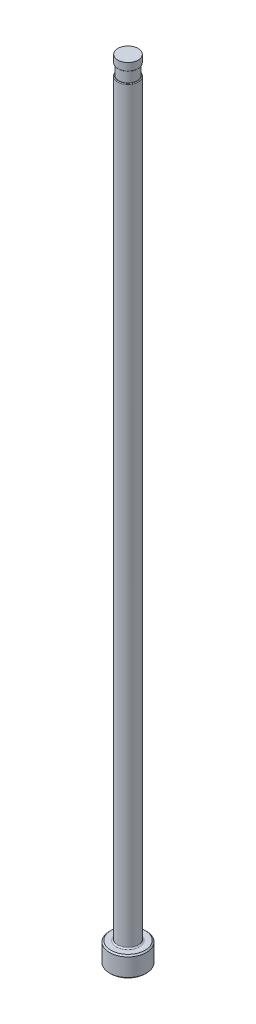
ISO-10303-21;
HEADER;
FILE_DESCRIPTION(('STEP AP214'),'2;1');
FILE_NAME('part.step','',(''),(''),'','','');
FILE_SCHEMA(('AUTOMOTIVE_DESIGN { 1 0 10303 214 1 1 1 1 }'));
ENDSEC;
DATA;
#1=APPLICATION_CONTEXT('core data for automotive mechanical design processes');
#2=APPLICATION_PROTOCOL_DEFINITION('international standard','automotive_design',2000,#1);
#3=PRODUCT_CONTEXT('',#1,'mechanical');
#4=PRODUCT('Part','Part','',(#3));
#5=PRODUCT_RELATED_PRODUCT_CATEGORY('part','',(#4));
#6=PRODUCT_DEFINITION_FORMATION('','',#4);
#7=PRODUCT_DEFINITION_CONTEXT('part definition',#1,'design');
#8=PRODUCT_DEFINITION('design','',#6,#7);
#9=PRODUCT_DEFINITION_SHAPE('','',#8);
#10=(LENGTH_UNIT() NAMED_UNIT(*) SI_UNIT(.MILLI.,.METRE.));
#11=(NAMED_UNIT(*) PLANE_ANGLE_UNIT() SI_UNIT($,.RADIAN.));
#12=(NAMED_UNIT(*) SI_UNIT($,.STERADIAN.) SOLID_ANGLE_UNIT());
#13=UNCERTAINTY_MEASURE_WITH_UNIT(LENGTH_MEASURE(1.E-05),#10,'distance_accuracy_value','');
#14=(GEOMETRIC_REPRESENTATION_CONTEXT(3) GLOBAL_UNCERTAINTY_ASSIGNED_CONTEXT((#13)) GLOBAL_UNIT_ASSIGNED_CONTEXT((#10,
#11,#12)) REPRESENTATION_CONTEXT('',''));
#15=CARTESIAN_POINT('',(0.,0.,0.));
#16=DIRECTION('',(0.,0.,1.));
#17=DIRECTION('',(1.,0.,0.));
#18=AXIS2_PLACEMENT_3D('',#15,#16,#17);
#19=CARTESIAN_POINT('',(-1.98373999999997,150.876,0.));
#20=DIRECTION('',(0.,1.,0.));
#21=DIRECTION('',(0.,0.,1.));
#22=AXIS2_PLACEMENT_3D('',#19,#20,#21);
#23=PLANE('',#22);
#24=CARTESIAN_POINT('',(0.,150.876,0.));
#25=DIRECTION('',(0.,1.,0.));
#26=DIRECTION('',(0.,0.,1.));
#27=AXIS2_PLACEMENT_3D('',#24,#25,#26);
#28=CIRCLE('',#27,1.83133999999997);
#29=CARTESIAN_POINT('',(0.,150.876,1.83133999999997));
#30=VERTEX_POINT('',#29);
#31=EDGE_CURVE('E11',#30,#30,#28,.F.);
#32=ORIENTED_EDGE('',*,*,#31,.T.);
#33=EDGE_LOOP('',(#32));
#34=FACE_BOUND('',#33,.T.);
#35=CARTESIAN_POINT('',(0.,150.876,0.));
#36=DIRECTION('',(0.,1.,0.));
#37=DIRECTION('',(0.,0.,1.));
#38=AXIS2_PLACEMENT_3D('',#35,#36,#37);
#39=CIRCLE('',#38,1.78053999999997);
#40=CARTESIAN_POINT('',(0.,150.876,1.78053999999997));
#41=VERTEX_POINT('',#40);
#42=EDGE_CURVE('E78',#41,#41,#39,.T.);
#43=ORIENTED_EDGE('',*,*,#42,.T.);
#44=EDGE_LOOP('',(#43));
#45=FACE_BOUND('',#44,.T.);
#46=ADVANCED_FACE('F36',(#34,#45),#23,.F.);
#47=CARTESIAN_POINT('',(0.,259.958771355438,0.));
#48=DIRECTION('',(0.,1.,0.));
#49=DIRECTION('',(0.,0.,1.));
#50=AXIS2_PLACEMENT_3D('',#47,#48,#49);
#51=CYLINDRICAL_SURFACE('',#50,1.98373999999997);
#52=DIRECTION('',(0.,1.,0.));
#53=VECTOR('',#52,1.);
#54=CARTESIAN_POINT('',(-1.78053999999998,259.958771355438,-0.87458658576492));
#55=LINE('',#54,#53);
#56=CARTESIAN_POINT('',(-1.78053999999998,148.717,-0.87458658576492));
#57=VERTEX_POINT('',#56);
#58=CARTESIAN_POINT('',(-1.78053999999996,86.36,-0.874586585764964));
#59=VERTEX_POINT('',#58);
#60=EDGE_CURVE('E73',#57,#59,#55,.F.);
#61=ORIENTED_EDGE('',*,*,#60,.F.);
#62=CARTESIAN_POINT('',(0.,148.717,0.));
#63=DIRECTION('',(0.,-1.,0.));
#64=DIRECTION('',(0.,0.,-1.));
#65=AXIS2_PLACEMENT_3D('',#62,#63,#64);
#66=CIRCLE('',#65,1.98373999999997);
#67=CARTESIAN_POINT('',(-1.78053999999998,148.717,0.87458658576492));
#68=VERTEX_POINT('',#67);
#69=EDGE_CURVE('E51',#57,#68,#66,.T.);
#70=ORIENTED_EDGE('',*,*,#69,.T.);
#71=DIRECTION('',(0.,1.,0.));
#72=VECTOR('',#71,1.);
#73=CARTESIAN_POINT('',(-1.78053999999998,259.958771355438,0.87458658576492));
#74=LINE('',#73,#72);
#75=CARTESIAN_POINT('',(-1.78053999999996,86.36,0.874586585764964));
#76=VERTEX_POINT('',#75);
#77=EDGE_CURVE('E84',#76,#68,#74,.T.);
#78=ORIENTED_EDGE('',*,*,#77,.F.);
#79=CARTESIAN_POINT('',(-1.78053999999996,86.36,-0.874586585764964));
#80=CARTESIAN_POINT('',(-1.78053865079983,86.3272968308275,-0.874582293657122));
#81=CARTESIAN_POINT('',(-1.78104579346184,86.2946048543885,-0.873557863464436));
#82=CARTESIAN_POINT('',(-1.78306050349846,86.2293726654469,-0.869440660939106));
#83=CARTESIAN_POINT('',(-1.78456837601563,86.1968325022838,-0.866347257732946));
#84=CARTESIAN_POINT('',(-1.79058935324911,86.0993142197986,-0.853877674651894));
#85=CARTESIAN_POINT('',(-1.7965995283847,86.034794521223,-0.841311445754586));
#86=CARTESIAN_POINT('',(-1.81216655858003,85.908456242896,-0.807234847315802));
#87=CARTESIAN_POINT('',(-1.82173064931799,85.8466434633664,-0.785706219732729));
#88=CARTESIAN_POINT('',(-1.84353272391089,85.7278109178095,-0.733090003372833));
#89=CARTESIAN_POINT('',(-1.85576409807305,85.6707797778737,-0.702025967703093));
#90=CARTESIAN_POINT('',(-1.87864294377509,85.5756691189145,-0.637816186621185));
#91=CARTESIAN_POINT('',(-1.88904107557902,85.5361900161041,-0.606655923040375));
#92=CARTESIAN_POINT('',(-1.9096749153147,85.4629072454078,-0.538182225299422));
#93=CARTESIAN_POINT('',(-1.91991077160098,85.4290980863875,-0.500874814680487));
#94=CARTESIAN_POINT('',(-1.93765949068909,85.3732104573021,-0.426534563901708));
#95=CARTESIAN_POINT('',(-1.94535058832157,85.3501335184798,-0.390297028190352));
#96=CARTESIAN_POINT('',(-1.95906883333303,85.3101265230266,-0.31426420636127));
#97=CARTESIAN_POINT('',(-1.965096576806,85.2931942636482,-0.274470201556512));
#98=CARTESIAN_POINT('',(-1.97485334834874,85.2662257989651,-0.192104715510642));
#99=CARTESIAN_POINT('',(-1.97857112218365,85.2562233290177,-0.14952073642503));
#100=CARTESIAN_POINT('',(-1.98320696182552,85.243797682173,-0.0631103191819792));
#101=CARTESIAN_POINT('',(-1.98412600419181,85.2413718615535,-0.0192843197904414));
#102=CARTESIAN_POINT('',(-1.98310107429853,85.2441006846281,0.0642372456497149));
#103=CARTESIAN_POINT('',(-1.98140057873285,85.2486106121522,0.103958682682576));
#104=CARTESIAN_POINT('',(-1.97575922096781,85.2638264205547,0.182020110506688));
#105=CARTESIAN_POINT('',(-1.97181856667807,85.2745317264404,0.220360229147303));
#106=CARTESIAN_POINT('',(-1.96206992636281,85.301714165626,0.294827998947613));
#107=CARTESIAN_POINT('',(-1.95625507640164,85.3182125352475,0.330946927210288));
#108=CARTESIAN_POINT('',(-1.9432907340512,85.3563152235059,0.400107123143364));
#109=CARTESIAN_POINT('',(-1.93614084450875,85.3779210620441,0.433147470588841));
#110=CARTESIAN_POINT('',(-1.92029960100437,85.4279613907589,0.498934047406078));
#111=CARTESIAN_POINT('',(-1.91152531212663,85.4568706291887,0.531297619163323));
#112=CARTESIAN_POINT('',(-1.89377241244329,85.5190184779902,0.591469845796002));
#113=CARTESIAN_POINT('',(-1.88479370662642,85.5522591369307,0.619276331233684));
#114=CARTESIAN_POINT('',(-1.86569807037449,85.6283604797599,0.674838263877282));
#115=CARTESIAN_POINT('',(-1.85566100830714,85.6718824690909,0.701713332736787));
#116=CARTESIAN_POINT('',(-1.83693898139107,85.7624245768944,0.749356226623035));
#117=CARTESIAN_POINT('',(-1.82825528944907,85.8094479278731,0.770118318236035));
#118=CARTESIAN_POINT('',(-1.8111557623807,85.9161808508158,0.809629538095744));
#119=CARTESIAN_POINT('',(-1.8031876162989,85.9764653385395,0.827017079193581));
#120=CARTESIAN_POINT('',(-1.79067795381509,86.0990954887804,0.853764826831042));
#121=CARTESIAN_POINT('',(-1.78613494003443,86.1614402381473,0.863128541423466));
#122=CARTESIAN_POINT('',(-1.78247943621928,86.2467444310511,0.870628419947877));
#123=CARTESIAN_POINT('',(-1.78175210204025,86.2693874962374,0.872115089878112));
#124=CARTESIAN_POINT('',(-1.78078289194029,86.3146849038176,0.874092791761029));
#125=CARTESIAN_POINT('',(-1.78054010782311,86.3373391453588,0.874585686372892));
#126=CARTESIAN_POINT('',(-1.78053999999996,86.36,0.874586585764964));
#127=B_SPLINE_CURVE_WITH_KNOTS('',3,(#79,#80,#81,#82,#83,#84,#85,#86,#87,#88,#89,#90,#91,#92,
#93,#94,#95,#96,#97,#98,#99,#100,#101,#102,#103,#104,#105,#106,#107,#108,#109,#110,#111,#112,
#113,#114,#115,#116,#117,#118,#119,#120,#121,#122,#123,#124,#125,#126),.UNSPECIFIED.,.F.,.F.,(4,
2,2,2,2,2,2,2,2,2,2,2,2,2,2,2,2,2,2,2,2,2,2,4),(0.,0.098066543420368,0.196163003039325,
0.393415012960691,0.59107084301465,0.78824232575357,0.941736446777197,1.09508104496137,
1.22546509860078,1.35580236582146,1.48676976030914,1.6176914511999,1.73715752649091,
1.85661251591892,1.97651005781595,2.0964433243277,2.22876073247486,2.36114094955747,
2.51695507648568,2.67291488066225,2.86196277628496,3.05092797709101,3.11901829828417,
3.18698087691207),.UNSPECIFIED.);
#128=EDGE_CURVE('E81',#59,#76,#127,.T.);
#129=ORIENTED_EDGE('',*,*,#128,.F.);
#130=EDGE_LOOP('',(#61,#70,#78,#129));
#131=FACE_BOUND('',#130,.T.);
#132=CARTESIAN_POINT('',(0.,4.21640000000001,0.));
#133=DIRECTION('',(0.,1.,0.));
#134=DIRECTION('',(0.,0.,1.));
#135=AXIS2_PLACEMENT_3D('',#132,#133,#134);
#136=CIRCLE('',#135,1.98373999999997);
#137=CARTESIAN_POINT('',(0.,4.21640000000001,1.98373999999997));
#138=VERTEX_POINT('',#137);
#139=EDGE_CURVE('E116',#138,#138,#136,.T.);
#140=ORIENTED_EDGE('',*,*,#139,.T.);
#141=EDGE_LOOP('',(#140));
#142=FACE_BOUND('',#141,.T.);
#143=ADVANCED_FACE('F82',(#131,#142),#51,.T.);
#144=CARTESIAN_POINT('',(0.,0.,0.));
#145=DIRECTION('',(0.,-1.,0.));
#146=DIRECTION('',(0.,0.,-1.));
#147=AXIS2_PLACEMENT_3D('',#144,#145,#146);
#148=PLANE('',#147);
#149=CARTESIAN_POINT('',(0.,0.,0.));
#150=DIRECTION('',(0.,-1.,0.));
#151=DIRECTION('',(0.,0.,-1.));
#152=AXIS2_PLACEMENT_3D('',#149,#150,#151);
#153=CIRCLE('',#152,3.31469999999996);
#154=CARTESIAN_POINT('',(0.,0.,-3.31469999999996));
#155=VERTEX_POINT('',#154);
#156=EDGE_CURVE('E113',#155,#155,#153,.T.);
#157=ORIENTED_EDGE('',*,*,#156,.T.);
#158=EDGE_LOOP('',(#157));
#159=FACE_BOUND('',#158,.T.);
#160=ADVANCED_FACE('F192',(#159),#148,.T.);
#161=CARTESIAN_POINT('',(0.,259.958771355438,0.));
#162=DIRECTION('',(0.,1.,0.));
#163=DIRECTION('',(0.,0.,1.));
#164=AXIS2_PLACEMENT_3D('',#161,#162,#163);
#165=CYLINDRICAL_SURFACE('',#164,3.56869999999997);
#166=CARTESIAN_POINT('',(0.,3.70839999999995,0.));
#167=DIRECTION('',(0.,1.,0.));
#168=DIRECTION('',(0.,0.,1.));
#169=AXIS2_PLACEMENT_3D('',#166,#167,#168);
#170=CIRCLE('',#169,3.56869999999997);
#171=CARTESIAN_POINT('',(0.,3.70839999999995,3.56869999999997));
#172=VERTEX_POINT('',#171);
#173=EDGE_CURVE('E110',#172,#172,#170,.F.);
#174=ORIENTED_EDGE('',*,*,#173,.T.);
#175=EDGE_LOOP('',(#174));
#176=FACE_BOUND('',#175,.T.);
#177=CARTESIAN_POINT('',(0.,0.254000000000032,0.));
#178=DIRECTION('',(0.,-1.,0.));
#179=DIRECTION('',(0.,0.,-1.));
#180=AXIS2_PLACEMENT_3D('',#177,#178,#179);
#181=CIRCLE('',#180,3.56869999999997);
#182=CARTESIAN_POINT('',(0.,0.254000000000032,-3.56869999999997));
#183=VERTEX_POINT('',#182);
#184=EDGE_CURVE('E107',#183,#183,#181,.F.);
#185=ORIENTED_EDGE('',*,*,#184,.T.);
#186=EDGE_LOOP('',(#185));
#187=FACE_BOUND('',#186,.T.);
#188=ADVANCED_FACE('F195',(#176,#187),#165,.T.);
#189=CARTESIAN_POINT('',(-3.56869999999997,3.9624,0.));
#190=DIRECTION('',(0.,1.,0.));
#191=DIRECTION('',(0.,0.,1.));
#192=AXIS2_PLACEMENT_3D('',#189,#190,#191);
#193=PLANE('',#192);
#194=CARTESIAN_POINT('',(0.,3.9624,0.));
#195=DIRECTION('',(0.,1.,0.));
#196=DIRECTION('',(0.,0.,1.));
#197=AXIS2_PLACEMENT_3D('',#194,#195,#196);
#198=CIRCLE('',#197,2.23773999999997);
#199=CARTESIAN_POINT('',(0.,3.9624,2.23773999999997));
#200=VERTEX_POINT('',#199);
#201=EDGE_CURVE('E87',#200,#200,#198,.F.);
#202=ORIENTED_EDGE('',*,*,#201,.T.);
#203=EDGE_LOOP('',(#202));
#204=FACE_BOUND('',#203,.T.);
#205=CARTESIAN_POINT('',(0.,3.9624,0.));
#206=DIRECTION('',(0.,1.,0.));
#207=DIRECTION('',(0.,0.,1.));
#208=AXIS2_PLACEMENT_3D('',#205,#206,#207);
#209=CIRCLE('',#208,3.31469999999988);
#210=CARTESIAN_POINT('',(0.,3.9624,3.31469999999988));
#211=VERTEX_POINT('',#210);
#212=EDGE_CURVE('E104',#211,#211,#209,.T.);
#213=ORIENTED_EDGE('',*,*,#212,.T.);
#214=EDGE_LOOP('',(#213));
#215=FACE_BOUND('',#214,.T.);
#216=ADVANCED_FACE('F190',(#204,#215),#193,.T.);
#217=CARTESIAN_POINT('',(0.,3.96239999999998,0.));
#218=DIRECTION('',(0.,-1.,0.));
#219=DIRECTION('',(0.,0.,-1.));
#220=AXIS2_PLACEMENT_3D('',#217,#218,#219);
#221=CONICAL_SURFACE('',#220,3.31469999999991,0.785398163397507);
#222=ORIENTED_EDGE('',*,*,#173,.F.);
#223=EDGE_LOOP('',(#222));
#224=FACE_BOUND('',#223,.T.);
#225=ORIENTED_EDGE('',*,*,#212,.F.);
#226=EDGE_LOOP('',(#225));
#227=FACE_BOUND('',#226,.T.);
#228=ADVANCED_FACE('F186',(#224,#227),#221,.T.);
#229=CARTESIAN_POINT('',(0.,0.254000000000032,0.));
#230=DIRECTION('',(0.,1.,0.));
#231=DIRECTION('',(0.,0.,1.));
#232=AXIS2_PLACEMENT_3D('',#229,#230,#231);
#233=CONICAL_SURFACE('',#232,3.56869999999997,0.785398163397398);
#234=ORIENTED_EDGE('',*,*,#156,.F.);
#235=EDGE_LOOP('',(#234));
#236=FACE_BOUND('',#235,.T.);
#237=ORIENTED_EDGE('',*,*,#184,.F.);
#238=EDGE_LOOP('',(#237));
#239=FACE_BOUND('',#238,.T.);
#240=ADVANCED_FACE('F182',(#236,#239),#233,.T.);
#241=CARTESIAN_POINT('',(0.,4.21640000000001,0.));
#242=DIRECTION('',(0.,1.,0.));
#243=DIRECTION('',(0.,0.,1.));
#244=AXIS2_PLACEMENT_3D('',#241,#242,#243);
#245=TOROIDAL_SURFACE('',#244,2.23773999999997,0.254);
#246=ORIENTED_EDGE('',*,*,#201,.F.);
#247=EDGE_LOOP('',(#246));
#248=FACE_BOUND('',#247,.T.);
#249=ORIENTED_EDGE('',*,*,#139,.F.);
#250=EDGE_LOOP('',(#249));
#251=FACE_BOUND('',#250,.T.);
#252=ADVANCED_FACE('F147',(#248,#251),#245,.F.);
#253=CARTESIAN_POINT('',(-1.98373999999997,148.844,0.));
#254=DIRECTION('',(0.,-1.,0.));
#255=DIRECTION('',(0.,0.,-1.));
#256=AXIS2_PLACEMENT_3D('',#253,#254,#255);
#257=PLANE('',#256);
#258=DIRECTION('',(0.,0.,1.));
#259=VECTOR('',#258,1.);
#260=CARTESIAN_POINT('',(-1.78053999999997,148.844,0.));
#261=LINE('',#260,#259);
#262=CARTESIAN_POINT('',(-1.78053999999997,148.844,0.));
#263=VERTEX_POINT('',#262);
#264=CARTESIAN_POINT('',(-1.78053999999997,148.844,0.526460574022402));
#265=VERTEX_POINT('',#264);
#266=EDGE_CURVE('E90',#263,#265,#261,.T.);
#267=ORIENTED_EDGE('',*,*,#266,.T.);
#268=CARTESIAN_POINT('',(0.,148.844,0.));
#269=DIRECTION('',(0.,-1.,0.));
#270=DIRECTION('',(0.,0.,-1.));
#271=AXIS2_PLACEMENT_3D('',#268,#269,#270);
#272=CIRCLE('',#271,1.85673999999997);
#273=CARTESIAN_POINT('',(-1.78053999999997,148.844,-0.526460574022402));
#274=VERTEX_POINT('',#273);
#275=EDGE_CURVE('E86',#265,#274,#272,.F.);
#276=ORIENTED_EDGE('',*,*,#275,.T.);
#277=EDGE_CURVE('E79',#274,#263,#261,.T.);
#278=ORIENTED_EDGE('',*,*,#277,.T.);
#279=CARTESIAN_POINT('',(0.,148.844,0.));
#280=DIRECTION('',(0.,1.,0.));
#281=DIRECTION('',(0.,0.,1.));
#282=AXIS2_PLACEMENT_3D('',#279,#280,#281);
#283=CIRCLE('',#282,1.78053999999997);
#284=EDGE_CURVE('E101',#263,#263,#283,.T.);
#285=ORIENTED_EDGE('',*,*,#284,.F.);
#286=EDGE_LOOP('',(#267,#276,#278,#285));
#287=FACE_BOUND('',#286,.T.);
#288=ADVANCED_FACE('F144',(#287),#257,.F.);
#289=CARTESIAN_POINT('',(0.,153.448281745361,0.));
#290=DIRECTION('',(0.,1.,0.));
#291=DIRECTION('',(0.,0.,1.));
#292=AXIS2_PLACEMENT_3D('',#289,#290,#291);
#293=CYLINDRICAL_SURFACE('',#292,1.78053999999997);
#294=ORIENTED_EDGE('',*,*,#42,.F.);
#295=EDGE_LOOP('',(#294));
#296=FACE_BOUND('',#295,.T.);
#297=ORIENTED_EDGE('',*,*,#284,.T.);
#298=EDGE_LOOP('',(#297));
#299=FACE_BOUND('',#298,.T.);
#300=ADVANCED_FACE('F141',(#296,#299),#293,.T.);
#301=CARTESIAN_POINT('',(-1.78053999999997,149.86,-3.56869999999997));
#302=DIRECTION('',(1.,0.,0.));
#303=DIRECTION('',(0.,1.,0.));
#304=AXIS2_PLACEMENT_3D('',#301,#302,#303);
#305=PLANE('',#304);
#306=ORIENTED_EDGE('',*,*,#277,.F.);
#307=CARTESIAN_POINT('',(-1.78053999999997,148.844,-0.526460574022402));
#308=CARTESIAN_POINT('',(-1.78053999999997,148.843978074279,-0.547390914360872));
#309=CARTESIAN_POINT('',(-1.78053999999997,148.84358039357,-0.568347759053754));
#310=CARTESIAN_POINT('',(-1.78053999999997,148.841614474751,-0.610487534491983));
#311=CARTESIAN_POINT('',(-1.78053999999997,148.840030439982,-0.631669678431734));
#312=CARTESIAN_POINT('',(-1.78053999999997,148.835173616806,-0.674541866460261));
#313=CARTESIAN_POINT('',(-1.78053999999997,148.831847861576,-0.696226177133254));
#314=CARTESIAN_POINT('',(-1.78053999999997,148.822728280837,-0.739006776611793));
#315=CARTESIAN_POINT('',(-1.78053999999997,148.816950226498,-0.760105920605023));
#316=CARTESIAN_POINT('',(-1.78053999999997,148.806654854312,-0.787147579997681));
#317=CARTESIAN_POINT('',(-1.78053999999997,148.803896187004,-0.793754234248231));
#318=CARTESIAN_POINT('',(-1.78053999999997,148.797851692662,-0.806726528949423));
#319=CARTESIAN_POINT('',(-1.78053999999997,148.794565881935,-0.813092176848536));
#320=CARTESIAN_POINT('',(-1.78053999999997,148.787320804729,-0.82550926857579));
#321=CARTESIAN_POINT('',(-1.78053999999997,148.783355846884,-0.83155744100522));
#322=CARTESIAN_POINT('',(-1.78053999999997,148.77461692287,-0.843040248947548));
#323=CARTESIAN_POINT('',(-1.78053999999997,148.769845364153,-0.84847663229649));
#324=CARTESIAN_POINT('',(-1.78053999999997,148.761648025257,-0.856139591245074));
#325=CARTESIAN_POINT('',(-1.78053999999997,148.758558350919,-0.858723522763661));
#326=CARTESIAN_POINT('',(-1.78053999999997,148.752050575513,-0.863452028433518));
#327=CARTESIAN_POINT('',(-1.78053999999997,148.748632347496,-0.865596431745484));
#328=CARTESIAN_POINT('',(-1.78053999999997,148.741433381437,-0.869319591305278));
#329=CARTESIAN_POINT('',(-1.78053999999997,148.737648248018,-0.870890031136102));
#330=CARTESIAN_POINT('',(-1.78053999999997,148.729845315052,-0.873246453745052));
#331=CARTESIAN_POINT('',(-1.78053999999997,148.725828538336,-0.874035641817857));
#332=CARTESIAN_POINT('',(-1.78053999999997,148.720987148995,-0.8744503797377));
#333=CARTESIAN_POINT('',(-1.78053999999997,148.72019041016,-0.874501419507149));
#334=CARTESIAN_POINT('',(-1.78053999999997,148.718595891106,-0.874569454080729));
#335=CARTESIAN_POINT('',(-1.78053999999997,148.717798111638,-0.874586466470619));
#336=CARTESIAN_POINT('',(-1.78053999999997,148.717,-0.874586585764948));
#337=B_SPLINE_CURVE_WITH_KNOTS('',3,(#307,#308,#309,#310,#311,#312,#313,#314,#315,#316,#317,
#318,#319,#320,#321,#322,#323,#324,#325,#326,#327,#328,#329,#330,#331,#332,#333,#334,#335,#336),
.UNSPECIFIED.,.F.,.F.,(4,2,2,2,2,2,2,2,2,2,2,2,2,2,4),(0.,0.0628307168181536,0.126513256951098,
0.192255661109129,0.257581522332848,0.279042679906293,0.300503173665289,0.322153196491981,
0.343739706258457,0.355794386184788,0.367853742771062,0.380081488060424,0.392258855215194,
0.394653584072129,0.397047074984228),.UNSPECIFIED.);
#338=EDGE_CURVE('E59',#274,#57,#337,.T.);
#339=ORIENTED_EDGE('',*,*,#338,.T.);
#340=ORIENTED_EDGE('',*,*,#60,.T.);
#341=DIRECTION('',(0.,0.,1.));
#342=VECTOR('',#341,1.);
#343=CARTESIAN_POINT('',(-1.78053999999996,86.36,-3.56869999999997));
#344=LINE('',#343,#342);
#345=EDGE_CURVE('E77',#59,#76,#344,.T.);
#346=ORIENTED_EDGE('',*,*,#345,.T.);
#347=ORIENTED_EDGE('',*,*,#77,.T.);
#348=CARTESIAN_POINT('',(-1.78053999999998,148.717,0.87458658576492));
#349=CARTESIAN_POINT('',(-1.78053999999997,148.720428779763,0.874595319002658));
#350=CARTESIAN_POINT('',(-1.78053999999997,148.72384637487,0.874272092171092));
#351=CARTESIAN_POINT('',(-1.78053999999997,148.730538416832,0.873041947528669));
#352=CARTESIAN_POINT('',(-1.78053999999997,148.733814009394,0.872141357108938));
#353=CARTESIAN_POINT('',(-1.78053999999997,148.740906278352,0.869569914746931));
#354=CARTESIAN_POINT('',(-1.78053999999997,148.744675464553,0.867770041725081));
#355=CARTESIAN_POINT('',(-1.78053999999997,148.751882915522,0.863582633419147));
#356=CARTESIAN_POINT('',(-1.78053999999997,148.755319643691,0.861192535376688));
#357=CARTESIAN_POINT('',(-1.78053999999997,148.763682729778,0.854521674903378));
#358=CARTESIAN_POINT('',(-1.78053999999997,148.768361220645,0.849933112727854));
#359=CARTESIAN_POINT('',(-1.78053999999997,148.776984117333,0.840123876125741));
#360=CARTESIAN_POINT('',(-1.78053999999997,148.780927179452,0.834902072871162));
#361=CARTESIAN_POINT('',(-1.78053999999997,148.791616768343,0.819005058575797));
#362=CARTESIAN_POINT('',(-1.78053999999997,148.797546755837,0.807787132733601));
#363=CARTESIAN_POINT('',(-1.78053999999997,148.807885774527,0.784614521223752));
#364=CARTESIAN_POINT('',(-1.78053999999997,148.812281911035,0.772654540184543));
#365=CARTESIAN_POINT('',(-1.78053999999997,148.822197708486,0.741171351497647));
#366=CARTESIAN_POINT('',(-1.78053999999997,148.826834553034,0.721373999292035));
#367=CARTESIAN_POINT('',(-1.78053999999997,148.834183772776,0.681384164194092));
#368=CARTESIAN_POINT('',(-1.78053999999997,148.836888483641,0.661190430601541));
#369=CARTESIAN_POINT('',(-1.78053999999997,148.840786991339,0.62184007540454));
#370=CARTESIAN_POINT('',(-1.78053999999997,148.842058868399,0.602690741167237));
#371=CARTESIAN_POINT('',(-1.78053999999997,148.843654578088,0.564509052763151));
#372=CARTESIAN_POINT('',(-1.78053999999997,148.843986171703,0.545477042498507));
#373=CARTESIAN_POINT('',(-1.78053999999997,148.844,0.526460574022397));
#374=B_SPLINE_CURVE_WITH_KNOTS('',3,(#348,#349,#350,#351,#352,#353,#354,#355,#356,#357,#358,
#359,#360,#361,#362,#363,#364,#365,#366,#367,#368,#369,#370,#371,#372,#373),.UNSPECIFIED.,.F.,
.F.,(4,2,2,2,2,2,2,2,2,2,2,2,4),(0.,0.0102530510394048,0.0203956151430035,0.0328568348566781,
0.045373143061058,0.064921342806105,0.0845049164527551,0.122359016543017,0.160524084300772,
0.221350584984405,0.282417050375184,0.339964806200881,0.397036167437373),.UNSPECIFIED.);
#375=EDGE_CURVE('E172',#68,#265,#374,.T.);
#376=ORIENTED_EDGE('',*,*,#375,.T.);
#377=ORIENTED_EDGE('',*,*,#266,.F.);
#378=EDGE_LOOP('',(#306,#339,#340,#346,#347,#376,#377));
#379=FACE_BOUND('',#378,.T.);
#380=ADVANCED_FACE('F75',(#379),#305,.F.);
#381=CARTESIAN_POINT('',(-4.95553999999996,86.36,-3.56869999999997));
#382=DIRECTION('',(0.,0.,1.));
#383=DIRECTION('',(1.,0.,0.));
#384=AXIS2_PLACEMENT_3D('',#381,#382,#383);
#385=CYLINDRICAL_SURFACE('',#384,3.175);
#386=ORIENTED_EDGE('',*,*,#345,.F.);
#387=ORIENTED_EDGE('',*,*,#128,.T.);
#388=EDGE_LOOP('',(#386,#387));
#389=FACE_BOUND('',#388,.T.);
#390=ADVANCED_FACE('F89',(#389),#385,.F.);
#391=CARTESIAN_POINT('',(0.,152.687735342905,0.));
#392=DIRECTION('',(0.,1.,0.));
#393=DIRECTION('',(0.,0.,1.));
#394=AXIS2_PLACEMENT_3D('',#391,#392,#393);
#395=CYLINDRICAL_SURFACE('',#394,1.95833999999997);
#396=CARTESIAN_POINT('',(0.,151.003,0.));
#397=DIRECTION('',(0.,1.,0.));
#398=DIRECTION('',(0.,0.,1.));
#399=AXIS2_PLACEMENT_3D('',#396,#397,#398);
#400=CIRCLE('',#399,1.95833999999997);
#401=CARTESIAN_POINT('',(0.,151.003,1.95833999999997));
#402=VERTEX_POINT('',#401);
#403=EDGE_CURVE('E44',#402,#402,#400,.T.);
#404=ORIENTED_EDGE('',*,*,#403,.T.);
#405=EDGE_LOOP('',(#404));
#406=FACE_BOUND('',#405,.T.);
#407=CARTESIAN_POINT('',(0.,152.4,0.));
#408=DIRECTION('',(0.,1.,0.));
#409=DIRECTION('',(0.,0.,1.));
#410=AXIS2_PLACEMENT_3D('',#407,#408,#409);
#411=CIRCLE('',#410,1.95833999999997);
#412=CARTESIAN_POINT('',(0.,152.4,1.95833999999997));
#413=VERTEX_POINT('',#412);
#414=EDGE_CURVE('E91',#413,#413,#411,.T.);
#415=ORIENTED_EDGE('',*,*,#414,.F.);
#416=EDGE_LOOP('',(#415));
#417=FACE_BOUND('',#416,.T.);
#418=ADVANCED_FACE('F135',(#406,#417),#395,.T.);
#419=CARTESIAN_POINT('',(-1.98373999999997,152.4,0.));
#420=DIRECTION('',(0.,1.,0.));
#421=DIRECTION('',(0.,0.,1.));
#422=AXIS2_PLACEMENT_3D('',#419,#420,#421);
#423=PLANE('',#422);
#424=ORIENTED_EDGE('',*,*,#414,.T.);
#425=EDGE_LOOP('',(#424));
#426=FACE_BOUND('',#425,.T.);
#427=ADVANCED_FACE('F149',(#426),#423,.T.);
#428=CARTESIAN_POINT('',(0.,148.717,0.));
#429=DIRECTION('',(0.,-1.,0.));
#430=DIRECTION('',(0.,0.,-1.));
#431=AXIS2_PLACEMENT_3D('',#428,#429,#430);
#432=TOROIDAL_SURFACE('',#431,1.85673999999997,0.127);
#433=ORIENTED_EDGE('',*,*,#375,.F.);
#434=ORIENTED_EDGE('',*,*,#69,.F.);
#435=ORIENTED_EDGE('',*,*,#338,.F.);
#436=ORIENTED_EDGE('',*,*,#275,.F.);
#437=EDGE_LOOP('',(#433,#434,#435,#436));
#438=FACE_BOUND('',#437,.T.);
#439=ADVANCED_FACE('F151',(#438),#432,.T.);
#440=CARTESIAN_POINT('',(0.,151.003,0.));
#441=DIRECTION('',(0.,1.,0.));
#442=DIRECTION('',(0.,0.,1.));
#443=AXIS2_PLACEMENT_3D('',#440,#441,#442);
#444=TOROIDAL_SURFACE('',#443,1.83133999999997,0.127);
#445=ORIENTED_EDGE('',*,*,#31,.F.);
#446=EDGE_LOOP('',(#445));
#447=FACE_BOUND('',#446,.T.);
#448=ORIENTED_EDGE('',*,*,#403,.F.);
#449=EDGE_LOOP('',(#448));
#450=FACE_BOUND('',#449,.T.);
#451=ADVANCED_FACE('F38',(#447,#450),#444,.T.);
#452=CLOSED_SHELL('',(#46,#143,#160,#188,#216,#228,#240,#252,#288,#300,#380,#390,#418,#427,#439,#451));
#453=MANIFOLD_SOLID_BREP('B2',#452);
#454=ADVANCED_BREP_SHAPE_REPRESENTATION('',(#18,#453),#14);
#455=SHAPE_DEFINITION_REPRESENTATION(#9,#454);
ENDSEC;
END-ISO-10303-21;
